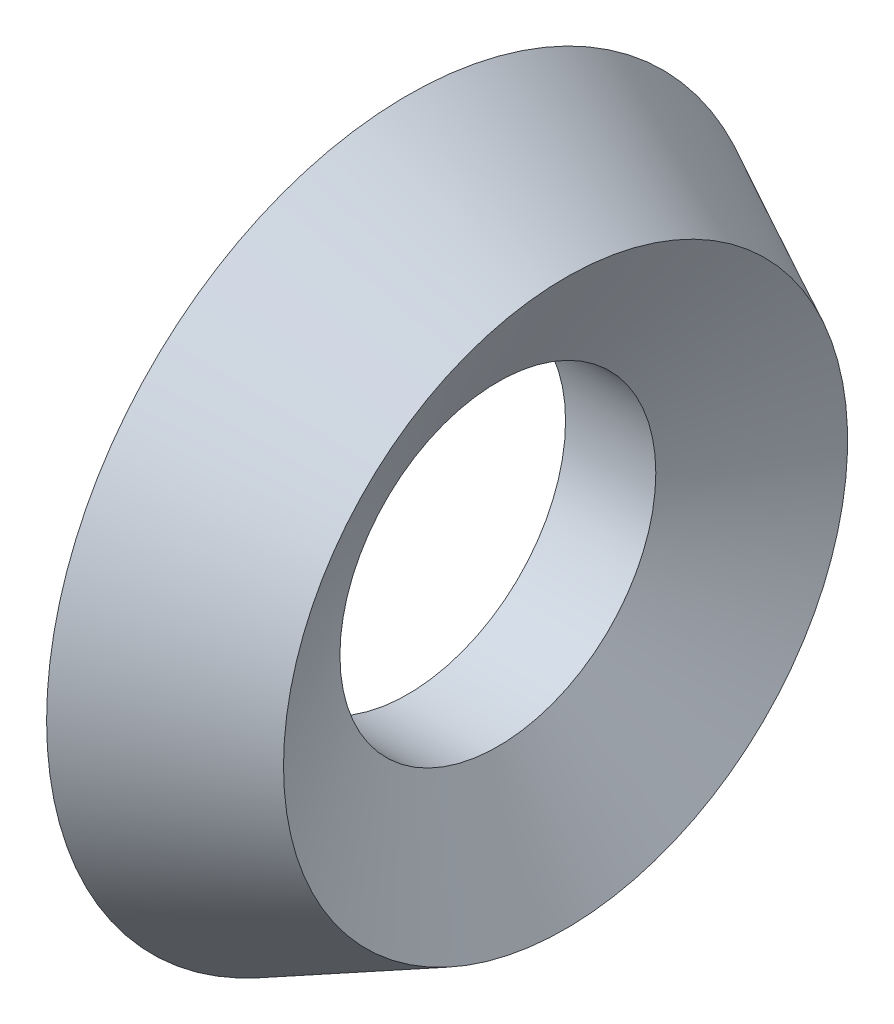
from build123d import *


with BuildPart() as part:
    # Esquisse1 → Base-R_volution (revolve)
    with BuildSketch(Plane.XY, mode=Mode.PRIVATE) as base_r_volution_sk:
        Polygon((0, 3.5), (0, 8), (3.5, 6.25), (2, 3.5), align=None)
    revolve(base_r_volution_sk.sketch.rotate(Axis((-10, 0, 0), (1, 0, 0)), 90), axis=Axis((-10, 0, 0), (1, 0, 0)))


solid = part.part
